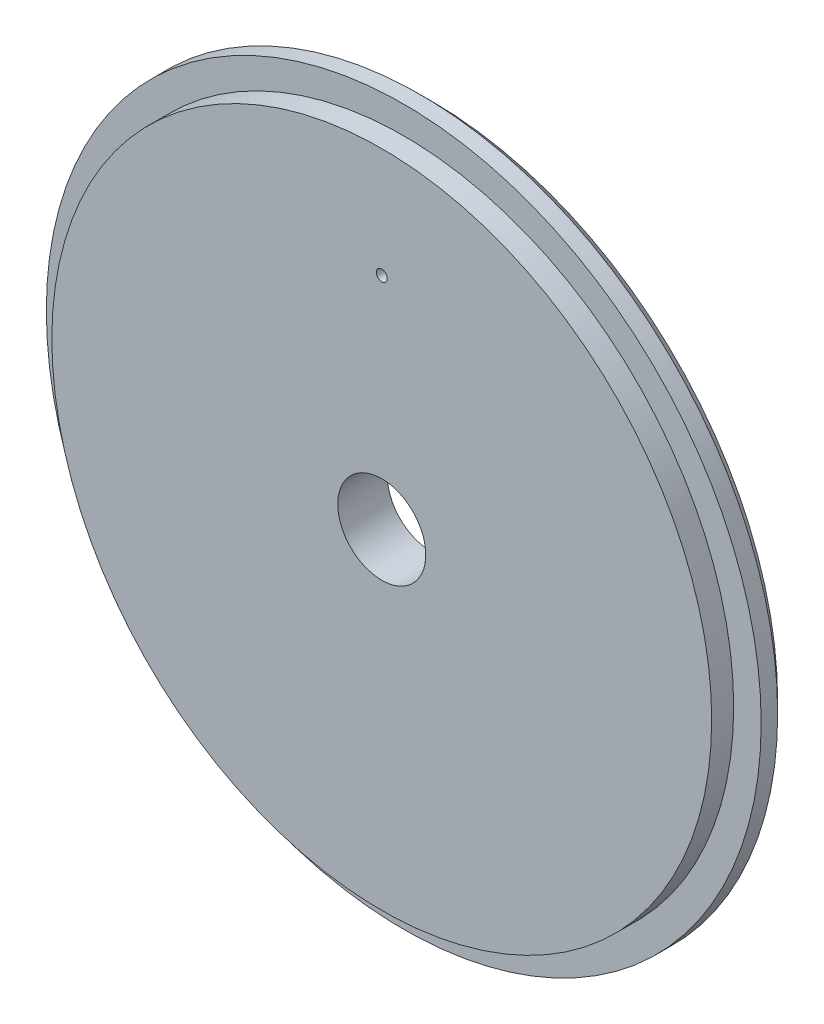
from build123d import *

# Parameters (mm, degrees)
ESQUISSE1_R                       = 32.5
BOSS_EXTRU_1_DEPTH                = 2.5
ESQUISSE2_R                       = 30
BOSS_EXTRU_2_DEPTH                = 2
DIAM_TRE_DU_PER_AGE_0_15_0_15_1_D = 8
DIAM_TRE_DU_PER_AGE_0_15_0_15_2_D = 1
CHANFREIN1_SIZE                   = 1


with BuildPart() as part:
    # Esquisse1 → Boss.-Extru.1 (new body)
    with BuildSketch(Plane.XY):
        Circle(ESQUISSE1_R)
    extrude(amount=BOSS_EXTRU_1_DEPTH)

    # Esquisse2 → Boss.-Extru.2 (add)
    with BuildSketch(Plane.XY.offset(2.5)):
        Circle(ESQUISSE2_R)
    extrude(amount=BOSS_EXTRU_2_DEPTH)

    # Diam_tre du per_age _0.15 _0.15_1 (through all)
    with Locations(Plane(origin=(0, 0, 0), x_dir=(-1, 0, 0), z_dir=(0, 0, -1))):
        with Locations((0, 0)):
            Hole(DIAM_TRE_DU_PER_AGE_0_15_0_15_1_D / 2)

    # Diam_tre du per_age _0.15 _0.15_2 (through all)
    with Locations(Plane(origin=(0, 0, 0), x_dir=(-1, 0, 0), z_dir=(0, 0, -1))):
        with Locations((0, 20)):
            Hole(DIAM_TRE_DU_PER_AGE_0_15_0_15_2_D / 2)

    # Chanfrein1
    chanfrein1_edges = [part.edges().sort_by_distance(p)[0] for p in [
        (-32.5, 0, 0),
    ]]
    chamfer(chanfrein1_edges, length=CHANFREIN1_SIZE)


solid = part.part
